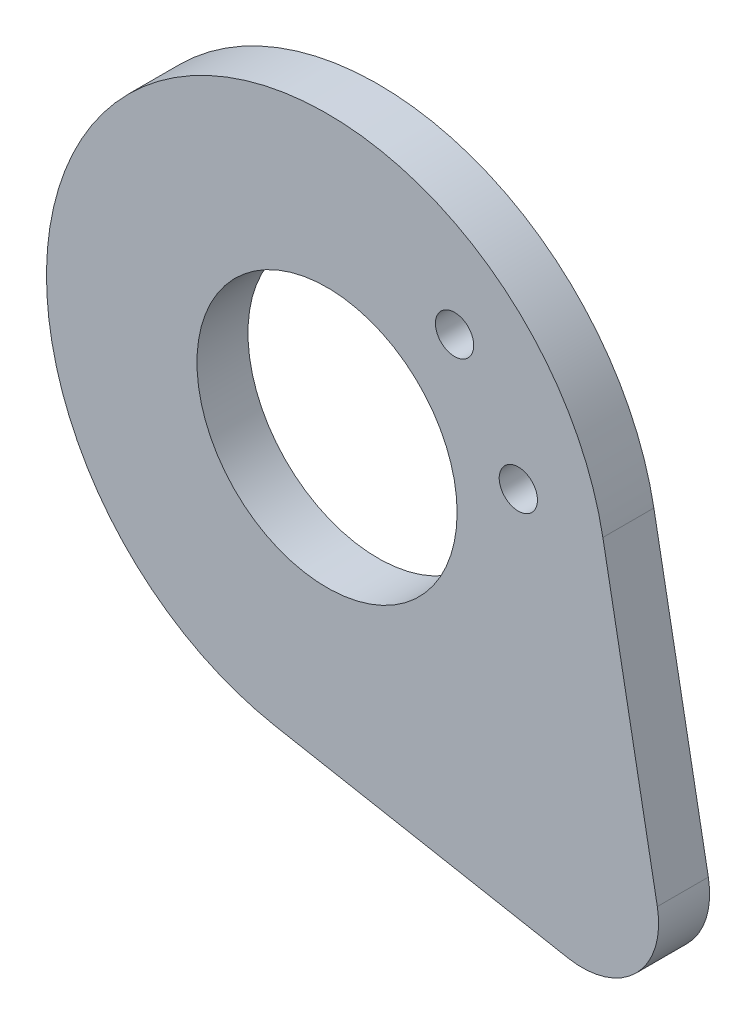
from build123d import *

# Parameters (mm, degrees)
SK_PLACA_TOPE_R   = 5.1
SK_PLACA_TOPE_R_2 = 0.75
PLACA_TOPE_DEPTH  = 2


with BuildPart() as part:
    # Sk_Placa_tope → Placa_tope (new body)
    with BuildSketch(Plane.XY.offset(52.4)):
        with BuildLine():
            Line((-8.014047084, -36.814047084), (3.450714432, -38.949285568))
            ThreePointArc((3.450714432, -38.949285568), (6.121320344, -38.121320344), (6.949285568, -35.450714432))
            Line((6.949285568, -35.450714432), (4.814047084, -23.985952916))
            ThreePointArc((4.814047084, -23.985952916), (-13.778174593, -18.221825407), (-8.014047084, -36.814047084))
        make_face()
        with Locations((-6, -26)):
            Circle(SK_PLACA_TOPE_R, mode=Mode.SUBTRACT)
        with Locations((-1, -20)):
            Circle(SK_PLACA_TOPE_R_2, mode=Mode.SUBTRACT)
        with Locations((1.5, -24)):
            Circle(SK_PLACA_TOPE_R_2, mode=Mode.SUBTRACT)
    extrude(amount=PLACA_TOPE_DEPTH)


solid = part.part
